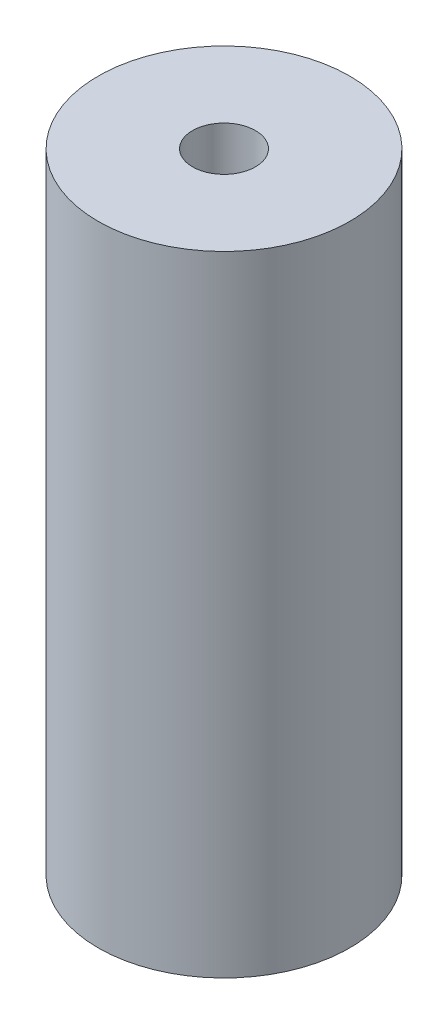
from build123d import *

# Parameters (mm, degrees)
SKETCH1_R                       = 12.7
SKETCH1_R_2                     = 3.175
EXTRUDE1_DEPTH                  = 63.5
F_33_0_113_DIAMETER_HOLE1_D     = 2.8702
F_33_0_113_DIAMETER_HOLE1_DEPTH = 25.4
F_33_0_113_DIAMETER_HOLE1_TIP   = 0.862295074


with BuildPart() as part:
    # Sketch1 → Extrude1 (new body)
    with BuildSketch(Plane(origin=(0, 0, 0), x_dir=(1, 0, 0), z_dir=(0, 1, 0))):
        with Locations(Location((0, 0, 0), (0, 0, 270))):
            Circle(SKETCH1_R)
        with Locations(Location((0, 0, 0), (0, 0, 270))):
            Circle(SKETCH1_R_2, mode=Mode.SUBTRACT)
    extrude(amount=EXTRUDE1_DEPTH)

    # 33 _0.113_ Diameter Hole1
    with Locations(Plane(origin=(-7.9375, 0, 0), x_dir=(0, 0, -1), z_dir=(0, -1, 0))):
        with Locations((0, 0), (0, 15.875)):
            Hole(F_33_0_113_DIAMETER_HOLE1_D / 2, depth=F_33_0_113_DIAMETER_HOLE1_DEPTH)
            with Locations((0, 0, -(F_33_0_113_DIAMETER_HOLE1_DEPTH + F_33_0_113_DIAMETER_HOLE1_TIP / 2))):  # 118° drill point
                Cone(0, F_33_0_113_DIAMETER_HOLE1_D / 2, F_33_0_113_DIAMETER_HOLE1_TIP, mode=Mode.SUBTRACT)


solid = part.part
